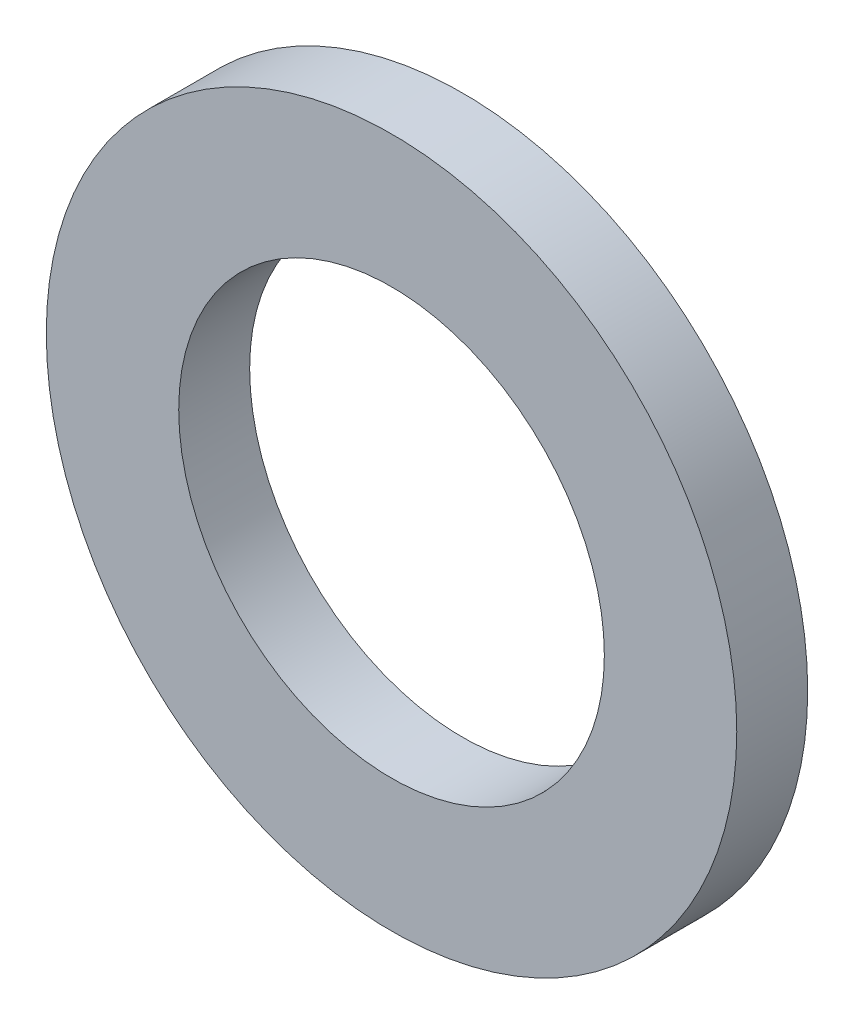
from build123d import *

# Parameters (mm, degrees)
SCHIZZO1_R       = 48.665313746
SCHIZZO1_R_2     = 30
EXTRUSION1_DEPTH = 10


with BuildPart() as part:
    # Schizzo1 → Extrusion1 (new body)
    with BuildSketch(Plane.XY):
        Circle(SCHIZZO1_R)
        Circle(SCHIZZO1_R_2, mode=Mode.SUBTRACT)
    extrude(amount=EXTRUSION1_DEPTH)


solid = part.part
